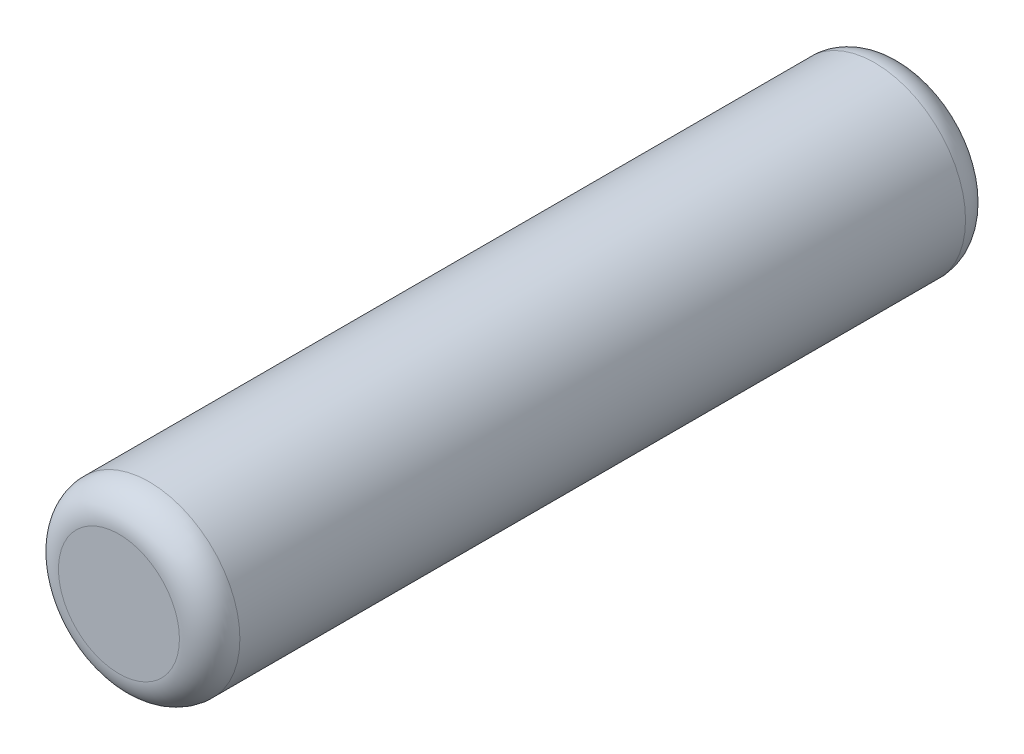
ISO-10303-21;
HEADER;
FILE_DESCRIPTION(('STEP AP214'),'2;1');
FILE_NAME('part.step','',(''),(''),'','','');
FILE_SCHEMA(('AUTOMOTIVE_DESIGN { 1 0 10303 214 1 1 1 1 }'));
ENDSEC;
DATA;
#1=APPLICATION_CONTEXT('core data for automotive mechanical design processes');
#2=APPLICATION_PROTOCOL_DEFINITION('international standard','automotive_design',2000,#1);
#3=PRODUCT_CONTEXT('',#1,'mechanical');
#4=PRODUCT('Part','Part','',(#3));
#5=PRODUCT_RELATED_PRODUCT_CATEGORY('part','',(#4));
#6=PRODUCT_DEFINITION_FORMATION('','',#4);
#7=PRODUCT_DEFINITION_CONTEXT('part definition',#1,'design');
#8=PRODUCT_DEFINITION('design','',#6,#7);
#9=PRODUCT_DEFINITION_SHAPE('','',#8);
#10=(LENGTH_UNIT() NAMED_UNIT(*) SI_UNIT(.MILLI.,.METRE.));
#11=(NAMED_UNIT(*) PLANE_ANGLE_UNIT() SI_UNIT($,.RADIAN.));
#12=(NAMED_UNIT(*) SI_UNIT($,.STERADIAN.) SOLID_ANGLE_UNIT());
#13=UNCERTAINTY_MEASURE_WITH_UNIT(LENGTH_MEASURE(1.E-05),#10,'distance_accuracy_value','');
#14=(GEOMETRIC_REPRESENTATION_CONTEXT(3) GLOBAL_UNCERTAINTY_ASSIGNED_CONTEXT((#13)) GLOBAL_UNIT_ASSIGNED_CONTEXT((#10,
#11,#12)) REPRESENTATION_CONTEXT('',''));
#15=CARTESIAN_POINT('',(0.,0.,0.));
#16=DIRECTION('',(0.,0.,1.));
#17=DIRECTION('',(1.,0.,0.));
#18=AXIS2_PLACEMENT_3D('',#15,#16,#17);
#19=CARTESIAN_POINT('',(0.,0.,6.5));
#20=DIRECTION('',(0.,0.,-1.));
#21=DIRECTION('',(-1.,0.,0.));
#22=AXIS2_PLACEMENT_3D('',#19,#20,#21);
#23=CYLINDRICAL_SURFACE('',#22,1.5);
#24=CARTESIAN_POINT('',(0.,0.,-6.));
#25=DIRECTION('',(0.,0.,1.));
#26=DIRECTION('',(1.,0.,0.));
#27=AXIS2_PLACEMENT_3D('',#24,#25,#26);
#28=CIRCLE('',#27,1.5);
#29=CARTESIAN_POINT('',(-1.5,0.,-6.));
#30=VERTEX_POINT('',#29);
#31=EDGE_CURVE('E40',#30,#30,#28,.T.);
#32=CARTESIAN_POINT('',(0.,0.,6.));
#33=DIRECTION('',(0.,0.,1.));
#34=DIRECTION('',(1.,0.,0.));
#35=AXIS2_PLACEMENT_3D('',#32,#33,#34);
#36=CIRCLE('',#35,1.5);
#37=CARTESIAN_POINT('',(-1.5,0.,6.));
#38=VERTEX_POINT('',#37);
#39=EDGE_CURVE('E44',#38,#38,#36,.F.);
#40=CARTESIAN_POINT('',(-1.5,0.,-6.));
#41=CARTESIAN_POINT('',(-1.5,0.,-5.875));
#42=CARTESIAN_POINT('',(-1.5,0.,-5.75));
#43=CARTESIAN_POINT('',(-1.5,0.,-5.5));
#44=CARTESIAN_POINT('',(-1.5,0.,-5.375));
#45=CARTESIAN_POINT('',(-1.5,0.,-5.125));
#46=CARTESIAN_POINT('',(-1.5,0.,-5.));
#47=CARTESIAN_POINT('',(-1.5,0.,-4.75));
#48=CARTESIAN_POINT('',(-1.5,0.,-4.625));
#49=CARTESIAN_POINT('',(-1.5,0.,-4.375));
#50=CARTESIAN_POINT('',(-1.5,0.,-4.25));
#51=CARTESIAN_POINT('',(-1.5,0.,-4.));
#52=CARTESIAN_POINT('',(-1.5,0.,-3.875));
#53=CARTESIAN_POINT('',(-1.5,0.,-3.625));
#54=CARTESIAN_POINT('',(-1.5,0.,-3.5));
#55=CARTESIAN_POINT('',(-1.5,0.,-3.25));
#56=CARTESIAN_POINT('',(-1.5,0.,-3.125));
#57=CARTESIAN_POINT('',(-1.5,0.,-2.875));
#58=CARTESIAN_POINT('',(-1.5,0.,-2.75));
#59=CARTESIAN_POINT('',(-1.5,0.,-2.5));
#60=CARTESIAN_POINT('',(-1.5,0.,-2.375));
#61=CARTESIAN_POINT('',(-1.5,0.,-2.125));
#62=CARTESIAN_POINT('',(-1.5,0.,-2.));
#63=CARTESIAN_POINT('',(-1.5,0.,-1.75));
#64=CARTESIAN_POINT('',(-1.5,0.,-1.625));
#65=CARTESIAN_POINT('',(-1.5,0.,-1.375));
#66=CARTESIAN_POINT('',(-1.5,0.,-1.25));
#67=CARTESIAN_POINT('',(-1.5,0.,-1.));
#68=CARTESIAN_POINT('',(-1.5,0.,-0.875000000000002));
#69=CARTESIAN_POINT('',(-1.5,0.,-0.625000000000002));
#70=CARTESIAN_POINT('',(-1.5,0.,-0.500000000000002));
#71=CARTESIAN_POINT('',(-1.5,0.,-0.250000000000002));
#72=CARTESIAN_POINT('',(-1.5,0.,-0.125000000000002));
#73=CARTESIAN_POINT('',(-1.5,0.,0.124999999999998));
#74=CARTESIAN_POINT('',(-1.5,0.,0.249999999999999));
#75=CARTESIAN_POINT('',(-1.5,0.,0.499999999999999));
#76=CARTESIAN_POINT('',(-1.5,0.,0.624999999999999));
#77=CARTESIAN_POINT('',(-1.5,0.,0.874999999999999));
#78=CARTESIAN_POINT('',(-1.5,0.,0.999999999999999));
#79=CARTESIAN_POINT('',(-1.5,0.,1.25));
#80=CARTESIAN_POINT('',(-1.5,0.,1.375));
#81=CARTESIAN_POINT('',(-1.5,0.,1.625));
#82=CARTESIAN_POINT('',(-1.5,0.,1.75));
#83=CARTESIAN_POINT('',(-1.5,0.,2.));
#84=CARTESIAN_POINT('',(-1.5,0.,2.125));
#85=CARTESIAN_POINT('',(-1.5,0.,2.375));
#86=CARTESIAN_POINT('',(-1.5,0.,2.5));
#87=CARTESIAN_POINT('',(-1.5,0.,2.75));
#88=CARTESIAN_POINT('',(-1.5,0.,2.875));
#89=CARTESIAN_POINT('',(-1.5,0.,3.125));
#90=CARTESIAN_POINT('',(-1.5,0.,3.25));
#91=CARTESIAN_POINT('',(-1.5,0.,3.5));
#92=CARTESIAN_POINT('',(-1.5,0.,3.625));
#93=CARTESIAN_POINT('',(-1.5,0.,3.875));
#94=CARTESIAN_POINT('',(-1.5,0.,4.));
#95=CARTESIAN_POINT('',(-1.5,0.,4.25));
#96=CARTESIAN_POINT('',(-1.5,0.,4.375));
#97=CARTESIAN_POINT('',(-1.5,0.,4.625));
#98=CARTESIAN_POINT('',(-1.5,0.,4.75));
#99=CARTESIAN_POINT('',(-1.5,0.,5.));
#100=CARTESIAN_POINT('',(-1.5,0.,5.125));
#101=CARTESIAN_POINT('',(-1.5,0.,5.375));
#102=CARTESIAN_POINT('',(-1.5,0.,5.5));
#103=CARTESIAN_POINT('',(-1.5,0.,5.75));
#104=CARTESIAN_POINT('',(-1.5,0.,5.875));
#105=CARTESIAN_POINT('',(-1.5,0.,6.));
#106=B_SPLINE_CURVE_WITH_KNOTS('',3,(#40,#41,#42,#43,#44,#45,#46,#47,#48,#49,#50,#51,#52,#53,
#54,#55,#56,#57,#58,#59,#60,#61,#62,#63,#64,#65,#66,#67,#68,#69,#70,#71,#72,#73,#74,#75,#76,#77,
#78,#79,#80,#81,#82,#83,#84,#85,#86,#87,#88,#89,#90,#91,#92,#93,#94,#95,#96,#97,#98,#99,#100,
#101,#102,#103,#104,#105),.UNSPECIFIED.,.F.,.F.,(4,2,2,2,2,2,2,2,2,2,2,2,2,2,2,2,2,2,2,2,2,2,2,
2,2,2,2,2,2,2,2,2,4),(0.,0.375,0.750000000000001,1.125,1.5,1.875,2.25,2.625,3.,3.375,3.75,4.125,
4.5,4.875,5.25,5.625,6.,6.375,6.75,7.125,7.5,7.875,8.25,8.625,9.,9.375,9.75,10.125,10.5,10.875,
11.25,11.625,12.),.UNSPECIFIED.);
#107=EDGE_CURVE('BSEAM29',#30,#38,#106,.T.);
#108=ORIENTED_EDGE('',*,*,#31,.T.);
#109=ORIENTED_EDGE('',*,*,#39,.T.);
#110=ORIENTED_EDGE('',*,*,#107,.T.);
#111=ORIENTED_EDGE('',*,*,#107,.F.);
#112=EDGE_LOOP('',(#108,#110,#109,#111));
#113=FACE_BOUND('',#112,.T.);
#114=ADVANCED_FACE('F29',(#113),#23,.T.);
#115=CARTESIAN_POINT('',(0.,0.,6.5));
#116=DIRECTION('',(0.,0.,1.));
#117=DIRECTION('',(1.,0.,0.));
#118=AXIS2_PLACEMENT_3D('',#115,#116,#117);
#119=PLANE('',#118);
#120=CARTESIAN_POINT('',(0.,0.,6.5));
#121=DIRECTION('',(0.,0.,1.));
#122=DIRECTION('',(1.,0.,0.));
#123=AXIS2_PLACEMENT_3D('',#120,#121,#122);
#124=CIRCLE('',#123,1.);
#125=CARTESIAN_POINT('',(1.,0.,6.5));
#126=VERTEX_POINT('',#125);
#127=EDGE_CURVE('E10',#126,#126,#124,.T.);
#128=ORIENTED_EDGE('',*,*,#127,.T.);
#129=EDGE_LOOP('',(#128));
#130=FACE_BOUND('',#129,.T.);
#131=ADVANCED_FACE('F60',(#130),#119,.T.);
#132=CARTESIAN_POINT('',(0.,0.,-6.5));
#133=DIRECTION('',(0.,0.,1.));
#134=DIRECTION('',(1.,0.,0.));
#135=AXIS2_PLACEMENT_3D('',#132,#133,#134);
#136=PLANE('',#135);
#137=CARTESIAN_POINT('',(0.,0.,-6.5));
#138=DIRECTION('',(0.,0.,1.));
#139=DIRECTION('',(1.,0.,0.));
#140=AXIS2_PLACEMENT_3D('',#137,#138,#139);
#141=CIRCLE('',#140,1.);
#142=CARTESIAN_POINT('',(1.,0.,-6.5));
#143=VERTEX_POINT('',#142);
#144=EDGE_CURVE('E36',#143,#143,#141,.F.);
#145=ORIENTED_EDGE('',*,*,#144,.T.);
#146=EDGE_LOOP('',(#145));
#147=FACE_BOUND('',#146,.T.);
#148=ADVANCED_FACE('F57',(#147),#136,.F.);
#149=CARTESIAN_POINT('',(0.,0.,-6.));
#150=DIRECTION('',(0.,0.,1.));
#151=DIRECTION('',(1.,0.,0.));
#152=AXIS2_PLACEMENT_3D('',#149,#150,#151);
#153=TOROIDAL_SURFACE('',#152,1.,0.5);
#154=ORIENTED_EDGE('',*,*,#144,.F.);
#155=EDGE_LOOP('',(#154));
#156=FACE_BOUND('',#155,.T.);
#157=ORIENTED_EDGE('',*,*,#31,.F.);
#158=EDGE_LOOP('',(#157));
#159=FACE_BOUND('',#158,.T.);
#160=ADVANCED_FACE('F53',(#156,#159),#153,.T.);
#161=CARTESIAN_POINT('',(0.,0.,6.));
#162=DIRECTION('',(0.,0.,1.));
#163=DIRECTION('',(1.,0.,0.));
#164=AXIS2_PLACEMENT_3D('',#161,#162,#163);
#165=TOROIDAL_SURFACE('',#164,1.,0.5);
#166=ORIENTED_EDGE('',*,*,#39,.F.);
#167=EDGE_LOOP('',(#166));
#168=FACE_BOUND('',#167,.T.);
#169=ORIENTED_EDGE('',*,*,#127,.F.);
#170=EDGE_LOOP('',(#169));
#171=FACE_BOUND('',#170,.T.);
#172=ADVANCED_FACE('F31',(#168,#171),#165,.T.);
#173=CLOSED_SHELL('',(#114,#131,#148,#160,#172));
#174=MANIFOLD_SOLID_BREP('B2',#173);
#175=ADVANCED_BREP_SHAPE_REPRESENTATION('',(#18,#174),#14);
#176=SHAPE_DEFINITION_REPRESENTATION(#9,#175);
ENDSEC;
END-ISO-10303-21;
